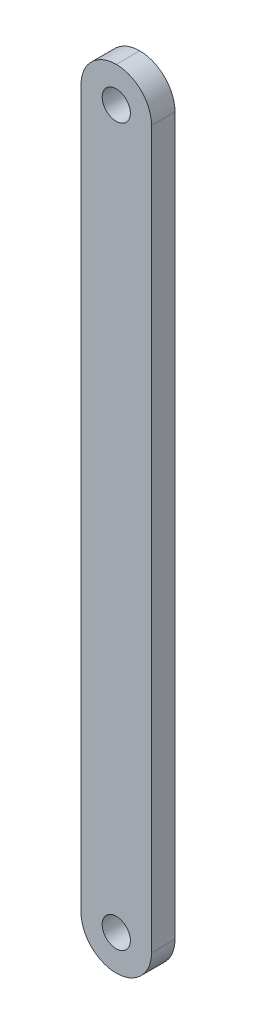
ISO-10303-21;
HEADER;
FILE_DESCRIPTION(('STEP AP214'),'2;1');
FILE_NAME('part.step','',(''),(''),'','','');
FILE_SCHEMA(('AUTOMOTIVE_DESIGN { 1 0 10303 214 1 1 1 1 }'));
ENDSEC;
DATA;
#1=APPLICATION_CONTEXT('core data for automotive mechanical design processes');
#2=APPLICATION_PROTOCOL_DEFINITION('international standard','automotive_design',2000,#1);
#3=PRODUCT_CONTEXT('',#1,'mechanical');
#4=PRODUCT('Part','Part','',(#3));
#5=PRODUCT_RELATED_PRODUCT_CATEGORY('part','',(#4));
#6=PRODUCT_DEFINITION_FORMATION('','',#4);
#7=PRODUCT_DEFINITION_CONTEXT('part definition',#1,'design');
#8=PRODUCT_DEFINITION('design','',#6,#7);
#9=PRODUCT_DEFINITION_SHAPE('','',#8);
#10=(LENGTH_UNIT() NAMED_UNIT(*) SI_UNIT(.MILLI.,.METRE.));
#11=(NAMED_UNIT(*) PLANE_ANGLE_UNIT() SI_UNIT($,.RADIAN.));
#12=(NAMED_UNIT(*) SI_UNIT($,.STERADIAN.) SOLID_ANGLE_UNIT());
#13=UNCERTAINTY_MEASURE_WITH_UNIT(LENGTH_MEASURE(1.E-05),#10,'distance_accuracy_value','');
#14=(GEOMETRIC_REPRESENTATION_CONTEXT(3) GLOBAL_UNCERTAINTY_ASSIGNED_CONTEXT((#13)) GLOBAL_UNIT_ASSIGNED_CONTEXT((#10,
#11,#12)) REPRESENTATION_CONTEXT('',''));
#15=CARTESIAN_POINT('',(0.,0.,0.));
#16=DIRECTION('',(0.,0.,1.));
#17=DIRECTION('',(1.,0.,0.));
#18=AXIS2_PLACEMENT_3D('',#15,#16,#17);
#19=CARTESIAN_POINT('',(15.,335.,10.));
#20=DIRECTION('',(0.,0.,-1.));
#21=DIRECTION('',(-1.,0.,0.));
#22=AXIS2_PLACEMENT_3D('',#19,#20,#21);
#23=PLANE('',#22);
#24=CARTESIAN_POINT('',(0.,320.,10.));
#25=DIRECTION('',(0.,0.,1.));
#26=DIRECTION('',(1.,0.,0.));
#27=AXIS2_PLACEMENT_3D('',#24,#25,#26);
#28=CIRCLE('',#27,6.00000000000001);
#29=CARTESIAN_POINT('',(6.,320.,10.));
#30=VERTEX_POINT('',#29);
#31=EDGE_CURVE('E136',#30,#30,#28,.T.);
#32=ORIENTED_EDGE('',*,*,#31,.F.);
#33=EDGE_LOOP('',(#32));
#34=FACE_BOUND('',#33,.T.);
#35=DIRECTION('',(0.,-1.,0.));
#36=VECTOR('',#35,1.);
#37=CARTESIAN_POINT('',(-15.,335.,10.));
#38=LINE('',#37,#36);
#39=CARTESIAN_POINT('',(-15.,320.,10.));
#40=VERTEX_POINT('',#39);
#41=CARTESIAN_POINT('',(-15.,15.,10.));
#42=VERTEX_POINT('',#41);
#43=EDGE_CURVE('E134',#40,#42,#38,.T.);
#44=ORIENTED_EDGE('',*,*,#43,.T.);
#45=CARTESIAN_POINT('',(0.,15.,10.));
#46=DIRECTION('',(0.,0.,-1.));
#47=DIRECTION('',(-1.,0.,0.));
#48=AXIS2_PLACEMENT_3D('',#45,#46,#47);
#49=CIRCLE('',#48,15.);
#50=CARTESIAN_POINT('',(0.,0.,10.));
#51=VERTEX_POINT('',#50);
#52=EDGE_CURVE('E118',#42,#51,#49,.F.);
#53=ORIENTED_EDGE('',*,*,#52,.T.);
#54=CARTESIAN_POINT('',(0.,15.,10.));
#55=DIRECTION('',(0.,0.,-1.));
#56=DIRECTION('',(-1.,0.,0.));
#57=AXIS2_PLACEMENT_3D('',#54,#55,#56);
#58=CIRCLE('',#57,15.);
#59=CARTESIAN_POINT('',(15.,15.,10.));
#60=VERTEX_POINT('',#59);
#61=EDGE_CURVE('E55',#51,#60,#58,.F.);
#62=ORIENTED_EDGE('',*,*,#61,.T.);
#63=DIRECTION('',(0.,1.,0.));
#64=VECTOR('',#63,1.);
#65=CARTESIAN_POINT('',(15.,0.,10.));
#66=LINE('',#65,#64);
#67=CARTESIAN_POINT('',(15.,320.,10.));
#68=VERTEX_POINT('',#67);
#69=EDGE_CURVE('E103',#60,#68,#66,.T.);
#70=ORIENTED_EDGE('',*,*,#69,.T.);
#71=CARTESIAN_POINT('',(0.,320.,10.));
#72=DIRECTION('',(0.,0.,-1.));
#73=DIRECTION('',(-1.,0.,0.));
#74=AXIS2_PLACEMENT_3D('',#71,#72,#73);
#75=CIRCLE('',#74,15.);
#76=CARTESIAN_POINT('',(0.,335.,10.));
#77=VERTEX_POINT('',#76);
#78=EDGE_CURVE('E122',#68,#77,#75,.F.);
#79=ORIENTED_EDGE('',*,*,#78,.T.);
#80=CARTESIAN_POINT('',(0.,320.,10.));
#81=DIRECTION('',(0.,0.,-1.));
#82=DIRECTION('',(-1.,0.,0.));
#83=AXIS2_PLACEMENT_3D('',#80,#81,#82);
#84=CIRCLE('',#83,15.);
#85=EDGE_CURVE('E106',#77,#40,#84,.F.);
#86=ORIENTED_EDGE('',*,*,#85,.T.);
#87=EDGE_LOOP('',(#44,#53,#62,#70,#79,#86));
#88=FACE_BOUND('',#87,.T.);
#89=CARTESIAN_POINT('',(0.,15.,10.));
#90=DIRECTION('',(0.,0.,1.));
#91=DIRECTION('',(1.,0.,0.));
#92=AXIS2_PLACEMENT_3D('',#89,#90,#91);
#93=CIRCLE('',#92,6.);
#94=CARTESIAN_POINT('',(5.99999999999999,15.,10.));
#95=VERTEX_POINT('',#94);
#96=EDGE_CURVE('E114',#95,#95,#93,.T.);
#97=ORIENTED_EDGE('',*,*,#96,.F.);
#98=EDGE_LOOP('',(#97));
#99=FACE_BOUND('',#98,.T.);
#100=ADVANCED_FACE('F32',(#34,#88,#99),#23,.F.);
#101=CARTESIAN_POINT('',(15.,335.,0.));
#102=DIRECTION('',(0.,0.,-1.));
#103=DIRECTION('',(-1.,0.,0.));
#104=AXIS2_PLACEMENT_3D('',#101,#102,#103);
#105=PLANE('',#104);
#106=CARTESIAN_POINT('',(0.,320.,0.));
#107=DIRECTION('',(0.,0.,1.));
#108=DIRECTION('',(1.,0.,0.));
#109=AXIS2_PLACEMENT_3D('',#106,#107,#108);
#110=CIRCLE('',#109,6.00000000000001);
#111=CARTESIAN_POINT('',(6.,320.,0.));
#112=VERTEX_POINT('',#111);
#113=EDGE_CURVE('E140',#112,#112,#110,.T.);
#114=ORIENTED_EDGE('',*,*,#113,.T.);
#115=EDGE_LOOP('',(#114));
#116=FACE_BOUND('',#115,.T.);
#117=CARTESIAN_POINT('',(0.,15.,0.));
#118=DIRECTION('',(0.,0.,-1.));
#119=DIRECTION('',(-1.,0.,0.));
#120=AXIS2_PLACEMENT_3D('',#117,#118,#119);
#121=CIRCLE('',#120,15.);
#122=CARTESIAN_POINT('',(15.,15.,0.));
#123=VERTEX_POINT('',#122);
#124=CARTESIAN_POINT('',(0.,0.,0.));
#125=VERTEX_POINT('',#124);
#126=EDGE_CURVE('E97',#123,#125,#121,.T.);
#127=ORIENTED_EDGE('',*,*,#126,.T.);
#128=CARTESIAN_POINT('',(0.,15.,0.));
#129=DIRECTION('',(0.,0.,-1.));
#130=DIRECTION('',(-1.,0.,0.));
#131=AXIS2_PLACEMENT_3D('',#128,#129,#130);
#132=CIRCLE('',#131,15.);
#133=CARTESIAN_POINT('',(-15.,15.,0.));
#134=VERTEX_POINT('',#133);
#135=EDGE_CURVE('E129',#125,#134,#132,.T.);
#136=ORIENTED_EDGE('',*,*,#135,.T.);
#137=DIRECTION('',(0.,-1.,0.));
#138=VECTOR('',#137,1.);
#139=CARTESIAN_POINT('',(-15.,335.,0.));
#140=LINE('',#139,#138);
#141=CARTESIAN_POINT('',(-15.,320.,0.));
#142=VERTEX_POINT('',#141);
#143=EDGE_CURVE('E92',#142,#134,#140,.T.);
#144=ORIENTED_EDGE('',*,*,#143,.F.);
#145=CARTESIAN_POINT('',(0.,320.,0.));
#146=DIRECTION('',(0.,0.,-1.));
#147=DIRECTION('',(-1.,0.,0.));
#148=AXIS2_PLACEMENT_3D('',#145,#146,#147);
#149=CIRCLE('',#148,15.);
#150=CARTESIAN_POINT('',(0.,335.,0.));
#151=VERTEX_POINT('',#150);
#152=EDGE_CURVE('E85',#142,#151,#149,.T.);
#153=ORIENTED_EDGE('',*,*,#152,.T.);
#154=CARTESIAN_POINT('',(0.,320.,0.));
#155=DIRECTION('',(0.,0.,-1.));
#156=DIRECTION('',(-1.,0.,0.));
#157=AXIS2_PLACEMENT_3D('',#154,#155,#156);
#158=CIRCLE('',#157,15.);
#159=CARTESIAN_POINT('',(15.,320.,0.));
#160=VERTEX_POINT('',#159);
#161=EDGE_CURVE('E90',#151,#160,#158,.T.);
#162=ORIENTED_EDGE('',*,*,#161,.T.);
#163=DIRECTION('',(0.,1.,0.));
#164=VECTOR('',#163,1.);
#165=CARTESIAN_POINT('',(15.,0.,0.));
#166=LINE('',#165,#164);
#167=EDGE_CURVE('E132',#123,#160,#166,.T.);
#168=ORIENTED_EDGE('',*,*,#167,.F.);
#169=EDGE_LOOP('',(#127,#136,#144,#153,#162,#168));
#170=FACE_BOUND('',#169,.T.);
#171=CARTESIAN_POINT('',(0.,15.,0.));
#172=DIRECTION('',(0.,0.,1.));
#173=DIRECTION('',(1.,0.,0.));
#174=AXIS2_PLACEMENT_3D('',#171,#172,#173);
#175=CIRCLE('',#174,6.);
#176=CARTESIAN_POINT('',(5.99999999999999,15.,0.));
#177=VERTEX_POINT('',#176);
#178=EDGE_CURVE('E109',#177,#177,#175,.T.);
#179=ORIENTED_EDGE('',*,*,#178,.T.);
#180=EDGE_LOOP('',(#179));
#181=FACE_BOUND('',#180,.T.);
#182=ADVANCED_FACE('F87',(#116,#170,#181),#105,.T.);
#183=CARTESIAN_POINT('',(-15.,335.,10.));
#184=DIRECTION('',(1.,0.,0.));
#185=DIRECTION('',(0.,1.,0.));
#186=AXIS2_PLACEMENT_3D('',#183,#184,#185);
#187=PLANE('',#186);
#188=ORIENTED_EDGE('',*,*,#143,.T.);
#189=DIRECTION('',(0.,0.,-1.));
#190=VECTOR('',#189,1.);
#191=CARTESIAN_POINT('',(-15.,15.,10.));
#192=LINE('',#191,#190);
#193=EDGE_CURVE('E124',#134,#42,#192,.F.);
#194=ORIENTED_EDGE('',*,*,#193,.T.);
#195=ORIENTED_EDGE('',*,*,#43,.F.);
#196=DIRECTION('',(0.,0.,-1.));
#197=VECTOR('',#196,1.);
#198=CARTESIAN_POINT('',(-15.,320.,10.));
#199=LINE('',#198,#197);
#200=EDGE_CURVE('E127',#40,#142,#199,.T.);
#201=ORIENTED_EDGE('',*,*,#200,.T.);
#202=EDGE_LOOP('',(#188,#194,#195,#201));
#203=FACE_BOUND('',#202,.T.);
#204=ADVANCED_FACE('F157',(#203),#187,.F.);
#205=CARTESIAN_POINT('',(15.,0.,10.));
#206=DIRECTION('',(-1.,0.,0.));
#207=DIRECTION('',(0.,-1.,0.));
#208=AXIS2_PLACEMENT_3D('',#205,#206,#207);
#209=PLANE('',#208);
#210=ORIENTED_EDGE('',*,*,#69,.F.);
#211=DIRECTION('',(0.,0.,-1.));
#212=VECTOR('',#211,1.);
#213=CARTESIAN_POINT('',(15.,15.,10.));
#214=LINE('',#213,#212);
#215=EDGE_CURVE('E11',#60,#123,#214,.T.);
#216=ORIENTED_EDGE('',*,*,#215,.T.);
#217=ORIENTED_EDGE('',*,*,#167,.T.);
#218=DIRECTION('',(0.,0.,-1.));
#219=VECTOR('',#218,1.);
#220=CARTESIAN_POINT('',(15.,320.,10.));
#221=LINE('',#220,#219);
#222=EDGE_CURVE('E41',#160,#68,#221,.F.);
#223=ORIENTED_EDGE('',*,*,#222,.T.);
#224=EDGE_LOOP('',(#210,#216,#217,#223));
#225=FACE_BOUND('',#224,.T.);
#226=ADVANCED_FACE('F165',(#225),#209,.F.);
#227=CARTESIAN_POINT('',(0.,320.,10.));
#228=DIRECTION('',(0.,0.,-1.));
#229=DIRECTION('',(-1.,0.,0.));
#230=AXIS2_PLACEMENT_3D('',#227,#228,#229);
#231=CYLINDRICAL_SURFACE('',#230,6.00000000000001);
#232=ORIENTED_EDGE('',*,*,#31,.T.);
#233=EDGE_LOOP('',(#232));
#234=FACE_BOUND('',#233,.T.);
#235=ORIENTED_EDGE('',*,*,#113,.F.);
#236=EDGE_LOOP('',(#235));
#237=FACE_BOUND('',#236,.T.);
#238=ADVANCED_FACE('F162',(#234,#237),#231,.F.);
#239=CARTESIAN_POINT('',(0.,15.,10.));
#240=DIRECTION('',(0.,0.,-1.));
#241=DIRECTION('',(-1.,0.,0.));
#242=AXIS2_PLACEMENT_3D('',#239,#240,#241);
#243=CYLINDRICAL_SURFACE('',#242,6.);
#244=ORIENTED_EDGE('',*,*,#96,.T.);
#245=EDGE_LOOP('',(#244));
#246=FACE_BOUND('',#245,.T.);
#247=ORIENTED_EDGE('',*,*,#178,.F.);
#248=EDGE_LOOP('',(#247));
#249=FACE_BOUND('',#248,.T.);
#250=ADVANCED_FACE('F148',(#246,#249),#243,.F.);
#251=CARTESIAN_POINT('',(0.,15.,10.));
#252=DIRECTION('',(0.,0.,-1.));
#253=DIRECTION('',(-1.,0.,0.));
#254=AXIS2_PLACEMENT_3D('',#251,#252,#253);
#255=CYLINDRICAL_SURFACE('',#254,15.);
#256=ORIENTED_EDGE('',*,*,#215,.F.);
#257=ORIENTED_EDGE('',*,*,#61,.F.);
#258=DIRECTION('',(0.,0.,-1.));
#259=VECTOR('',#258,1.);
#260=CARTESIAN_POINT('',(0.,0.,10.));
#261=LINE('',#260,#259);
#262=EDGE_CURVE('E107',#125,#51,#261,.F.);
#263=ORIENTED_EDGE('',*,*,#262,.F.);
#264=ORIENTED_EDGE('',*,*,#126,.F.);
#265=EDGE_LOOP('',(#256,#257,#263,#264));
#266=FACE_BOUND('',#265,.T.);
#267=ADVANCED_FACE('F174',(#266),#255,.T.);
#268=CARTESIAN_POINT('',(0.,15.,10.));
#269=DIRECTION('',(0.,0.,-1.));
#270=DIRECTION('',(-1.,0.,0.));
#271=AXIS2_PLACEMENT_3D('',#268,#269,#270);
#272=CYLINDRICAL_SURFACE('',#271,15.);
#273=ORIENTED_EDGE('',*,*,#52,.F.);
#274=ORIENTED_EDGE('',*,*,#193,.F.);
#275=ORIENTED_EDGE('',*,*,#135,.F.);
#276=ORIENTED_EDGE('',*,*,#262,.T.);
#277=EDGE_LOOP('',(#273,#274,#275,#276));
#278=FACE_BOUND('',#277,.T.);
#279=ADVANCED_FACE('F171',(#278),#272,.T.);
#280=CARTESIAN_POINT('',(0.,320.,10.));
#281=DIRECTION('',(0.,0.,-1.));
#282=DIRECTION('',(-1.,0.,0.));
#283=AXIS2_PLACEMENT_3D('',#280,#281,#282);
#284=CYLINDRICAL_SURFACE('',#283,15.);
#285=DIRECTION('',(0.,0.,-1.));
#286=VECTOR('',#285,1.);
#287=CARTESIAN_POINT('',(0.,335.,10.));
#288=LINE('',#287,#286);
#289=EDGE_CURVE('E36',#77,#151,#288,.T.);
#290=ORIENTED_EDGE('',*,*,#289,.F.);
#291=ORIENTED_EDGE('',*,*,#78,.F.);
#292=ORIENTED_EDGE('',*,*,#222,.F.);
#293=ORIENTED_EDGE('',*,*,#161,.F.);
#294=EDGE_LOOP('',(#290,#291,#292,#293));
#295=FACE_BOUND('',#294,.T.);
#296=ADVANCED_FACE('F34',(#295),#284,.T.);
#297=CARTESIAN_POINT('',(0.,320.,10.));
#298=DIRECTION('',(0.,0.,-1.));
#299=DIRECTION('',(-1.,0.,0.));
#300=AXIS2_PLACEMENT_3D('',#297,#298,#299);
#301=CYLINDRICAL_SURFACE('',#300,15.);
#302=ORIENTED_EDGE('',*,*,#85,.F.);
#303=ORIENTED_EDGE('',*,*,#289,.T.);
#304=ORIENTED_EDGE('',*,*,#152,.F.);
#305=ORIENTED_EDGE('',*,*,#200,.F.);
#306=EDGE_LOOP('',(#302,#303,#304,#305));
#307=FACE_BOUND('',#306,.T.);
#308=ADVANCED_FACE('F105',(#307),#301,.T.);
#309=CLOSED_SHELL('',(#100,#182,#204,#226,#238,#250,#267,#279,#296,#308));
#310=MANIFOLD_SOLID_BREP('B2',#309);
#311=ADVANCED_BREP_SHAPE_REPRESENTATION('',(#18,#310),#14);
#312=SHAPE_DEFINITION_REPRESENTATION(#9,#311);
ENDSEC;
END-ISO-10303-21;
